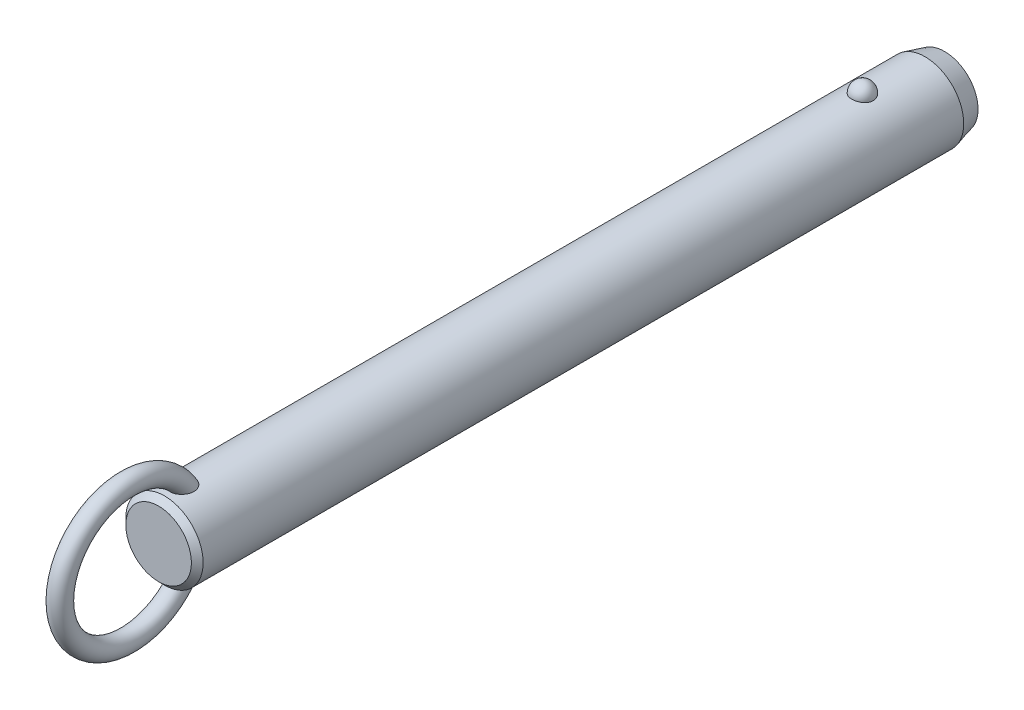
ISO-10303-21;
HEADER;
FILE_DESCRIPTION(('STEP AP214'),'2;1');
FILE_NAME('part.step','',(''),(''),'','','');
FILE_SCHEMA(('AUTOMOTIVE_DESIGN { 1 0 10303 214 1 1 1 1 }'));
ENDSEC;
DATA;
#1=APPLICATION_CONTEXT('core data for automotive mechanical design processes');
#2=APPLICATION_PROTOCOL_DEFINITION('international standard','automotive_design',2000,#1);
#3=PRODUCT_CONTEXT('',#1,'mechanical');
#4=PRODUCT('Part','Part','',(#3));
#5=PRODUCT_RELATED_PRODUCT_CATEGORY('part','',(#4));
#6=PRODUCT_DEFINITION_FORMATION('','',#4);
#7=PRODUCT_DEFINITION_CONTEXT('part definition',#1,'design');
#8=PRODUCT_DEFINITION('design','',#6,#7);
#9=PRODUCT_DEFINITION_SHAPE('','',#8);
#10=(LENGTH_UNIT() NAMED_UNIT(*) SI_UNIT(.MILLI.,.METRE.));
#11=(NAMED_UNIT(*) PLANE_ANGLE_UNIT() SI_UNIT($,.RADIAN.));
#12=(NAMED_UNIT(*) SI_UNIT($,.STERADIAN.) SOLID_ANGLE_UNIT());
#13=UNCERTAINTY_MEASURE_WITH_UNIT(LENGTH_MEASURE(1.E-05),#10,'distance_accuracy_value','');
#14=(GEOMETRIC_REPRESENTATION_CONTEXT(3) GLOBAL_UNCERTAINTY_ASSIGNED_CONTEXT((#13)) GLOBAL_UNIT_ASSIGNED_CONTEXT((#10,
#11,#12)) REPRESENTATION_CONTEXT('',''));
#15=CARTESIAN_POINT('',(0.,0.,0.));
#16=DIRECTION('',(0.,0.,1.));
#17=DIRECTION('',(1.,0.,0.));
#18=AXIS2_PLACEMENT_3D('',#15,#16,#17);
#19=CARTESIAN_POINT('',(0.,0.,132.1));
#20=DIRECTION('',(0.,0.,-1.));
#21=DIRECTION('',(-1.,0.,0.));
#22=AXIS2_PLACEMENT_3D('',#19,#20,#21);
#23=CYLINDRICAL_SURFACE('',#22,7.9);
#24=CARTESIAN_POINT('',(2.1785689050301,7.59367088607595,-2.19999999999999));
#25=CARTESIAN_POINT('',(2.17856679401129,7.59367269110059,-2.07701843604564));
#26=CARTESIAN_POINT('',(2.16853481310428,7.59657145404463,-1.95401006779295));
#27=CARTESIAN_POINT('',(2.12864689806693,7.607843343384,-1.71147811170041));
#28=CARTESIAN_POINT('',(2.09878338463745,7.61621856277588,-1.59195587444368));
#29=CARTESIAN_POINT('',(2.0199931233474,7.63749180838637,-1.3598563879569));
#30=CARTESIAN_POINT('',(1.97107475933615,7.6503878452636,-1.24727610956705));
#31=CARTESIAN_POINT('',(1.85539377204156,7.67926115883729,-1.03213234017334));
#32=CARTESIAN_POINT('',(1.78863158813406,7.69523835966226,-0.929568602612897));
#33=CARTESIAN_POINT('',(1.63856494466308,7.7285848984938,-0.736786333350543));
#34=CARTESIAN_POINT('',(1.55518140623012,7.7459606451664,-0.646630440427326));
#35=CARTESIAN_POINT('',(1.37422937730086,7.78009978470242,-0.481747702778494));
#36=CARTESIAN_POINT('',(1.27666086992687,7.79686317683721,-0.407020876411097));
#37=CARTESIAN_POINT('',(1.07024728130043,7.82786153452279,-0.275278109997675));
#38=CARTESIAN_POINT('',(0.961434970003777,7.84210353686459,-0.218212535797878));
#39=CARTESIAN_POINT('',(0.735351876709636,7.86652194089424,-0.123146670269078));
#40=CARTESIAN_POINT('',(0.618082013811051,7.87669878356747,-0.085144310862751));
#41=CARTESIAN_POINT('',(0.380637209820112,7.89170521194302,-0.0298158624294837));
#42=CARTESIAN_POINT('',(0.260550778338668,7.89662650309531,-0.0121347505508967));
#43=CARTESIAN_POINT('',(0.0190117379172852,7.90090003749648,0.00324379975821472));
#44=CARTESIAN_POINT('',(-0.102440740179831,7.90025280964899,0.00094313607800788));
#45=CARTESIAN_POINT('',(-0.341452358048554,7.89351056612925,-0.0233955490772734));
#46=CARTESIAN_POINT('',(-0.459042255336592,7.88749257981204,-0.0451545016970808));
#47=CARTESIAN_POINT('',(-0.688796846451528,7.87075812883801,-0.107408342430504));
#48=CARTESIAN_POINT('',(-0.800961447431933,7.86004158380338,-0.147903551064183));
#49=CARTESIAN_POINT('',(-1.01743634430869,7.83497131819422,-0.246799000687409));
#50=CARTESIAN_POINT('',(-1.12169791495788,7.82059709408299,-0.305300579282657));
#51=CARTESIAN_POINT('',(-1.31891765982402,7.78976470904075,-0.438549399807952));
#52=CARTESIAN_POINT('',(-1.41187469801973,7.77330633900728,-0.513298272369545));
#53=CARTESIAN_POINT('',(-1.58577142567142,7.73972434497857,-0.678622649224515));
#54=CARTESIAN_POINT('',(-1.66645140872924,7.72259402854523,-0.769470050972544));
#55=CARTESIAN_POINT('',(-1.81161503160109,7.68983776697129,-0.963538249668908));
#56=CARTESIAN_POINT('',(-1.87609753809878,7.6742119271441,-1.06675991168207));
#57=CARTESIAN_POINT('',(-1.98790138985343,7.6460202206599,-1.28401170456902));
#58=CARTESIAN_POINT('',(-2.03501994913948,7.63349104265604,-1.39815107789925));
#59=CARTESIAN_POINT('',(-2.10986724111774,7.6131449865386,-1.63301784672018));
#60=CARTESIAN_POINT('',(-2.1375965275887,7.60532797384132,-1.75374505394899));
#61=CARTESIAN_POINT('',(-2.17289256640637,7.5953195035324,-1.99782562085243));
#62=CARTESIAN_POINT('',(-2.18054294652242,7.59310471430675,-2.12116592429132));
#63=CARTESIAN_POINT('',(-2.17572919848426,7.59448538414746,-2.36741799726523));
#64=CARTESIAN_POINT('',(-2.1632656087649,7.59808068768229,-2.49032977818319));
#65=CARTESIAN_POINT('',(-2.11865035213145,7.61064035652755,-2.73161015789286));
#66=CARTESIAN_POINT('',(-2.08659579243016,7.61957823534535,-2.84999812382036));
#67=CARTESIAN_POINT('',(-2.00367799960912,7.64179982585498,-3.07955956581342));
#68=CARTESIAN_POINT('',(-1.9528140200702,7.65508371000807,-3.19073275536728));
#69=CARTESIAN_POINT('',(-1.83321113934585,7.68460381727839,-3.40337899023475));
#70=CARTESIAN_POINT('',(-1.76437735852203,7.70085556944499,-3.50479651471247));
#71=CARTESIAN_POINT('',(-1.61069526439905,7.73445734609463,-3.69446912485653));
#72=CARTESIAN_POINT('',(-1.52584634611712,7.75180741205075,-3.78272371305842));
#73=CARTESIAN_POINT('',(-1.34198059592,7.78574608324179,-3.94393987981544));
#74=CARTESIAN_POINT('',(-1.24291308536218,7.80233167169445,-4.01684434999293));
#75=CARTESIAN_POINT('',(-1.03352039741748,7.83281625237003,-4.14489386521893));
#76=CARTESIAN_POINT('',(-0.92319600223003,7.84671543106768,-4.20004014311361));
#77=CARTESIAN_POINT('',(-0.695822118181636,7.87011575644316,-4.29042017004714));
#78=CARTESIAN_POINT('',(-0.578872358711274,7.87966903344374,-4.32589112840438));
#79=CARTESIAN_POINT('',(-0.340410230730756,7.8935652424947,-4.37692226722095));
#80=CARTESIAN_POINT('',(-0.218898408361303,7.89790879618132,-4.39248482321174));
#81=CARTESIAN_POINT('',(0.0228107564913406,7.90087453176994,-4.40314405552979));
#82=CARTESIAN_POINT('',(0.142990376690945,7.89960185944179,-4.39861683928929));
#83=CARTESIAN_POINT('',(0.380829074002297,7.89171262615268,-4.37008293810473));
#84=CARTESIAN_POINT('',(0.498488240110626,7.8850962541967,-4.34607694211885));
#85=CARTESIAN_POINT('',(0.727535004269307,7.86726442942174,-4.27939317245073));
#86=CARTESIAN_POINT('',(0.838944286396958,7.85606616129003,-4.236785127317));
#87=CARTESIAN_POINT('',(1.05295421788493,7.83025654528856,-4.13408348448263));
#88=CARTESIAN_POINT('',(1.15555431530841,7.81564498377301,-4.07398879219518));
#89=CARTESIAN_POINT('',(1.35076763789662,7.7843022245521,-3.93687432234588));
#90=CARTESIAN_POINT('',(1.4432046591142,7.76754209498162,-3.85961036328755));
#91=CARTESIAN_POINT('',(1.6139111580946,7.73387857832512,-3.69076949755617));
#92=CARTESIAN_POINT('',(1.6921781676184,7.71697516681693,-3.59919010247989));
#93=CARTESIAN_POINT('',(1.83380875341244,7.6845643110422,-3.40247278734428));
#94=CARTESIAN_POINT('',(1.89689280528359,7.66908588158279,-3.29712873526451));
#95=CARTESIAN_POINT('',(2.0047823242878,7.64159441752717,-3.07707931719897));
#96=CARTESIAN_POINT('',(2.0495945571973,7.62958010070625,-2.96237743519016));
#97=CARTESIAN_POINT('',(2.11580183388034,7.61146617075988,-2.74040519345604));
#98=CARTESIAN_POINT('',(2.13929812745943,7.60484503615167,-2.63379846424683));
#99=CARTESIAN_POINT('',(2.17068242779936,7.59594664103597,-2.41813481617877));
#100=CARTESIAN_POINT('',(2.17857077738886,7.59366928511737,-2.30907795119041));
#101=CARTESIAN_POINT('',(2.1785689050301,7.59367088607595,-2.19999999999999));
#102=B_SPLINE_CURVE_WITH_KNOTS('',3,(#24,#25,#26,#27,#28,#29,#30,#31,#32,#33,#34,#35,#36,#37,
#38,#39,#40,#41,#42,#43,#44,#45,#46,#47,#48,#49,#50,#51,#52,#53,#54,#55,#56,#57,#58,#59,#60,#61,
#62,#63,#64,#65,#66,#67,#68,#69,#70,#71,#72,#73,#74,#75,#76,#77,#78,#79,#80,#81,#82,#83,#84,#85,
#86,#87,#88,#89,#90,#91,#92,#93,#94,#95,#96,#97,#98,#99,#100,#101),.UNSPECIFIED.,.T.,.F.,(4,2,2,
2,2,2,2,2,2,2,2,2,2,2,2,2,2,2,2,2,2,2,2,2,2,2,2,2,2,2,2,2,2,2,2,2,2,2,4),(0.,0.368552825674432,
0.737246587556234,1.10577831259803,1.4743009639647,1.8446206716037,2.21494081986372,
2.5842105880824,2.95344028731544,3.31611630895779,3.67875788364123,4.03628044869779,
4.39380913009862,4.75338791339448,5.11300280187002,5.47939989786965,5.8458226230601,
6.21639834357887,6.58696347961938,6.95598276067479,7.32499216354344,7.69218715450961,
8.0593967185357,8.42858578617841,8.79778880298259,9.16834203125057,9.5388695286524,
9.90482699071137,10.2707407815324,10.6298333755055,10.9889132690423,11.3466585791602,
11.7044262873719,12.0676511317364,12.4309391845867,12.8004764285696,13.1698767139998,
13.4967701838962,13.8236564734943),.UNSPECIFIED.);
#103=CARTESIAN_POINT('',(2.1785689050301,7.59367088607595,-2.19999999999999));
#104=VERTEX_POINT('',#103);
#105=EDGE_CURVE('E41',#104,#104,#102,.T.);
#106=ORIENTED_EDGE('',*,*,#105,.T.);
#107=EDGE_LOOP('',(#106));
#108=FACE_BOUND('',#107,.T.);
#109=CARTESIAN_POINT('',(0.,0.,140.42));
#110=DIRECTION('',(0.,0.,1.));
#111=DIRECTION('',(1.,0.,0.));
#112=AXIS2_PLACEMENT_3D('',#109,#110,#111);
#113=CIRCLE('',#112,7.9);
#114=CARTESIAN_POINT('',(7.9,0.,140.42));
#115=VERTEX_POINT('',#114);
#116=EDGE_CURVE('E10',#115,#115,#113,.F.);
#117=ORIENTED_EDGE('',*,*,#116,.T.);
#118=EDGE_LOOP('',(#117));
#119=FACE_BOUND('',#118,.T.);
#120=CARTESIAN_POINT('',(-0.630969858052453,-7.87476203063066,134.312432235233));
#121=CARTESIAN_POINT('',(-0.734180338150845,-7.86648998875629,134.347285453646));
#122=CARTESIAN_POINT('',(-0.83447695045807,-7.85639291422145,134.390816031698));
#123=CARTESIAN_POINT('',(-1.0262035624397,-7.83366343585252,134.494094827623));
#124=CARTESIAN_POINT('',(-1.1176141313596,-7.82102565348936,134.553877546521));
#125=CARTESIAN_POINT('',(-1.28877277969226,-7.79464922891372,134.687839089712));
#126=CARTESIAN_POINT('',(-1.36854014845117,-7.78091246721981,134.761993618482));
#127=CARTESIAN_POINT('',(-1.51461521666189,-7.75380398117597,134.922494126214));
#128=CARTESIAN_POINT('',(-1.58092966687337,-7.74043207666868,135.008833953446));
#129=CARTESIAN_POINT('',(-1.70019064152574,-7.7151252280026,135.192978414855));
#130=CARTESIAN_POINT('',(-1.75284037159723,-7.70322473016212,135.290979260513));
#131=CARTESIAN_POINT('',(-1.84263464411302,-7.68224112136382,135.494102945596));
#132=CARTESIAN_POINT('',(-1.87977299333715,-7.6731591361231,135.599228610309));
#133=CARTESIAN_POINT('',(-1.94152728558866,-7.65777930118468,135.823284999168));
#134=CARTESIAN_POINT('',(-1.96475471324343,-7.65179654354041,135.942616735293));
#135=CARTESIAN_POINT('',(-1.99449499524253,-7.64409642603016,136.18342986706));
#136=CARTESIAN_POINT('',(-2.0010005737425,-7.64238092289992,136.304912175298));
#137=CARTESIAN_POINT('',(-1.99856014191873,-7.64302120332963,136.568340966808));
#138=CARTESIAN_POINT('',(-1.98680021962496,-7.64611845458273,136.71025654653));
#139=CARTESIAN_POINT('',(-1.94457772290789,-7.65696186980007,136.991118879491));
#140=CARTESIAN_POINT('',(-1.91409393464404,-7.66471330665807,137.130062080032));
#141=CARTESIAN_POINT('',(-1.82768670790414,-7.68582947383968,137.431939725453));
#142=CARTESIAN_POINT('',(-1.76772963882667,-7.70003779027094,137.593686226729));
#143=CARTESIAN_POINT('',(-1.65998501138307,-7.72371550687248,137.827695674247));
#144=CARTESIAN_POINT('',(-1.621079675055,-7.73200670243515,137.904297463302));
#145=CARTESIAN_POINT('',(-1.53727726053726,-7.74910377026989,138.054079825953));
#146=CARTESIAN_POINT('',(-1.49238215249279,-7.75790947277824,138.127261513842));
#147=CARTESIAN_POINT('',(-1.37397050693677,-7.77993338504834,138.30288382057));
#148=CARTESIAN_POINT('',(-1.29690364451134,-7.79328473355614,138.402955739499));
#149=CARTESIAN_POINT('',(-1.12885487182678,-7.81939266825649,138.590714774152));
#150=CARTESIAN_POINT('',(-1.03789926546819,-7.83215032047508,138.678424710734));
#151=CARTESIAN_POINT('',(-0.869532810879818,-7.85231710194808,138.813414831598));
#152=CARTESIAN_POINT('',(-0.795716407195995,-7.86021093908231,138.865076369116));
#153=CARTESIAN_POINT('',(-0.640813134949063,-7.87434920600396,138.956381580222));
#154=CARTESIAN_POINT('',(-0.559737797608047,-7.88059619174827,138.99604389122));
#155=CARTESIAN_POINT('',(-0.406456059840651,-7.88984116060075,139.054300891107));
#156=CARTESIAN_POINT('',(-0.335227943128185,-7.89321892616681,139.075384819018));
#157=CARTESIAN_POINT('',(-0.190193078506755,-7.89804235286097,139.10541418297));
#158=CARTESIAN_POINT('',(-0.116388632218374,-7.89948969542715,139.114370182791));
#159=CARTESIAN_POINT('',(0.0318414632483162,-7.90028409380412,139.119291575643));
#160=CARTESIAN_POINT('',(0.106268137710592,-7.89962640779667,139.115227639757));
#161=CARTESIAN_POINT('',(0.253290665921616,-7.8962818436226,139.094461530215));
#162=CARTESIAN_POINT('',(0.325885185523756,-7.8935935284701,139.077750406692));
#163=CARTESIAN_POINT('',(0.481441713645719,-7.88577340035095,139.028738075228));
#164=CARTESIAN_POINT('',(0.563611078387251,-7.88026321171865,138.994005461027));
#165=CARTESIAN_POINT('',(0.721129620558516,-7.86741729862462,138.911796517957));
#166=CARTESIAN_POINT('',(0.79646633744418,-7.86007832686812,138.864297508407));
#167=CARTESIAN_POINT('',(0.971456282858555,-7.84073285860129,138.736513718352));
#168=CARTESIAN_POINT('',(1.06719686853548,-7.82809461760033,138.651004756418));
#169=CARTESIAN_POINT('',(1.24418921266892,-7.80192439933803,138.466232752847));
#170=CARTESIAN_POINT('',(1.32540832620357,-7.78839049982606,138.366939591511));
#171=CARTESIAN_POINT('',(1.45199971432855,-7.76559693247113,138.189576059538));
#172=CARTESIAN_POINT('',(1.50085649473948,-7.75626094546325,138.113954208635));
#173=CARTESIAN_POINT('',(1.59197749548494,-7.73807279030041,137.958742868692));
#174=CARTESIAN_POINT('',(1.63423919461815,-7.72922080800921,137.879151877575));
#175=CARTESIAN_POINT('',(1.71222612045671,-7.71231959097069,137.716664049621));
#176=CARTESIAN_POINT('',(1.74794516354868,-7.70427111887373,137.633764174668));
#177=CARTESIAN_POINT('',(1.81270113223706,-7.68929240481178,137.465296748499));
#178=CARTESIAN_POINT('',(1.84173789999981,-7.68236218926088,137.379729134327));
#179=CARTESIAN_POINT('',(1.89322698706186,-7.6698375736,137.20528702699));
#180=CARTESIAN_POINT('',(1.91558744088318,-7.66426199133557,137.116383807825));
#181=CARTESIAN_POINT('',(1.95281367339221,-7.65485915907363,136.936969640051));
#182=CARTESIAN_POINT('',(1.96767946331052,-7.65103190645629,136.846458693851));
#183=CARTESIAN_POINT('',(2.0002145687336,-7.64262981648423,136.573732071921));
#184=CARTESIAN_POINT('',(2.00600691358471,-7.6410871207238,136.389709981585));
#185=CARTESIAN_POINT('',(1.98445334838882,-7.64669564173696,136.076501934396));
#186=CARTESIAN_POINT('',(1.96607186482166,-7.65149688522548,135.946618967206));
#187=CARTESIAN_POINT('',(1.90884967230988,-7.66597624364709,135.691632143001));
#188=CARTESIAN_POINT('',(1.87002101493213,-7.67565148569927,135.566525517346));
#189=CARTESIAN_POINT('',(1.77063986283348,-7.69918471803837,135.32454013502));
#190=CARTESIAN_POINT('',(1.70993724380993,-7.71307150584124,135.207725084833));
#191=CARTESIAN_POINT('',(1.56733070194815,-7.74330306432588,134.988144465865));
#192=CARTESIAN_POINT('',(1.48543692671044,-7.75964665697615,134.885372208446));
#193=CARTESIAN_POINT('',(1.31346177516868,-7.79047523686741,134.709380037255));
#194=CARTESIAN_POINT('',(1.22547278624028,-7.80495298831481,134.634106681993));
#195=CARTESIAN_POINT('',(1.03724352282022,-7.83218597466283,134.500486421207));
#196=CARTESIAN_POINT('',(0.93700840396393,-7.84494192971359,134.442132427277));
#197=CARTESIAN_POINT('',(0.733599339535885,-7.86649045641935,134.347027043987));
#198=CARTESIAN_POINT('',(0.630941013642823,-7.87547134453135,134.309210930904));
#199=CARTESIAN_POINT('',(0.420465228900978,-7.88950708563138,134.251116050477));
#200=CARTESIAN_POINT('',(0.312645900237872,-7.89456050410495,134.23084369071));
#201=CARTESIAN_POINT('',(0.096086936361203,-7.9001518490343,134.208455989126));
#202=CARTESIAN_POINT('',(-0.0126341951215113,-7.90073226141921,134.206169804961));
#203=CARTESIAN_POINT('',(-0.228766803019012,-7.89742350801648,134.219367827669));
#204=CARTESIAN_POINT('',(-0.336180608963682,-7.89354403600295,134.234813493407));
#205=CARTESIAN_POINT('',(-0.473410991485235,-7.88586871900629,134.266217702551));
#206=CARTESIAN_POINT('',(-0.50525779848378,-7.88388984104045,134.274354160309));
#207=CARTESIAN_POINT('',(-0.56848128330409,-7.87958326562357,134.292208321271));
#208=CARTESIAN_POINT('',(-0.59985795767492,-7.87725556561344,134.301926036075));
#209=CARTESIAN_POINT('',(-0.630969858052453,-7.87476203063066,134.312432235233));
#210=B_SPLINE_CURVE_WITH_KNOTS('',3,(#120,#121,#122,#123,#124,#125,#126,#127,#128,#129,#130,
#131,#132,#133,#134,#135,#136,#137,#138,#139,#140,#141,#142,#143,#144,#145,#146,#147,#148,#149,
#150,#151,#152,#153,#154,#155,#156,#157,#158,#159,#160,#161,#162,#163,#164,#165,#166,#167,#168,
#169,#170,#171,#172,#173,#174,#175,#176,#177,#178,#179,#180,#181,#182,#183,#184,#185,#186,#187,
#188,#189,#190,#191,#192,#193,#194,#195,#196,#197,#198,#199,#200,#201,#202,#203,#204,#205,#206,
#207,#208,#209),.UNSPECIFIED.,.T.,.F.,(4,2,2,2,2,2,2,2,2,2,2,2,2,2,2,2,2,2,2,2,2,2,2,2,2,2,2,2,
2,2,2,2,2,2,2,2,2,2,2,2,2,2,2,2,4),(0.,0.327622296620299,0.655945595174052,0.983718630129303,
1.3113267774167,1.64554655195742,1.97989964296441,2.34365728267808,2.70757317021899,
3.13333684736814,3.5595838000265,4.07655306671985,4.33527897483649,4.59391999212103,
4.97382437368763,5.353017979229,5.62348245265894,5.89352465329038,6.11565959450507,
6.33760092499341,6.56004255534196,6.78264174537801,7.04930844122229,7.31645206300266,
7.70130871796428,8.08701995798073,8.35824509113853,8.6295736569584,8.9011573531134,
9.1727474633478,9.44791855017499,9.72308922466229,10.2715298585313,10.6638393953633,
11.0559179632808,11.4507403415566,11.8453740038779,12.1936425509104,12.5417649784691,
12.8695063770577,13.1973674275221,13.5221104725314,13.8461490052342,13.9449071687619,
14.0436660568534),.UNSPECIFIED.);
#211=CARTESIAN_POINT('',(-0.630969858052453,-7.87476203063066,134.312432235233));
#212=VERTEX_POINT('',#211);
#213=EDGE_CURVE('E59',#212,#212,#210,.T.);
#214=ORIENTED_EDGE('',*,*,#213,.T.);
#215=EDGE_LOOP('',(#214));
#216=FACE_BOUND('',#215,.T.);
#217=CARTESIAN_POINT('',(-0.630969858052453,7.87476203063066,134.312432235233));
#218=CARTESIAN_POINT('',(-0.528918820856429,7.88293636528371,134.277979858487));
#219=CARTESIAN_POINT('',(-0.423745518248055,7.88934810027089,134.251915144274));
#220=CARTESIAN_POINT('',(-0.210236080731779,7.8979273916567,134.217282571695));
#221=CARTESIAN_POINT('',(-0.10189380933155,7.90008607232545,134.208751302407));
#222=CARTESIAN_POINT('',(0.114660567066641,7.89990877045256,134.209457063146));
#223=CARTESIAN_POINT('',(0.222872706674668,7.89757640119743,134.21867980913));
#224=CARTESIAN_POINT('',(0.436107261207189,7.88867538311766,134.254652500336));
#225=CARTESIAN_POINT('',(0.541131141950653,7.8821087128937,134.28139425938));
#226=CARTESIAN_POINT('',(0.745085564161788,7.86545130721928,134.351756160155));
#227=CARTESIAN_POINT('',(0.844015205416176,7.85536005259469,134.395378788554));
#228=CARTESIAN_POINT('',(1.03299167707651,7.83275153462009,134.498379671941));
#229=CARTESIAN_POINT('',(1.12303841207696,7.8202342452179,134.557758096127));
#230=CARTESIAN_POINT('',(1.29214734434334,7.79408219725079,134.690864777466));
#231=CARTESIAN_POINT('',(1.37116907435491,7.78044359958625,134.764643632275));
#232=CARTESIAN_POINT('',(1.51597677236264,7.75353170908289,134.924235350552));
#233=CARTESIAN_POINT('',(1.58176261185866,7.74025841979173,135.010048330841));
#234=CARTESIAN_POINT('',(1.70057386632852,7.71504069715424,135.193644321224));
#235=CARTESIAN_POINT('',(1.75320073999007,7.7031425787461,135.291690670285));
#236=CARTESIAN_POINT('',(1.8429376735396,7.68216822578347,135.494893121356));
#237=CARTESIAN_POINT('',(1.88004278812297,7.67309289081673,135.600051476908));
#238=CARTESIAN_POINT('',(1.9417232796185,7.6577294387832,135.824167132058));
#239=CARTESIAN_POINT('',(1.96491037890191,7.65175648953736,135.943524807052));
#240=CARTESIAN_POINT('',(1.9945689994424,7.64407702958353,136.184384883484));
#241=CARTESIAN_POINT('',(2.00103304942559,7.64237242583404,136.30588821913));
#242=CARTESIAN_POINT('',(1.99850166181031,7.64303650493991,136.569368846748));
#243=CARTESIAN_POINT('',(1.98669038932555,7.64614714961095,136.711314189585));
#244=CARTESIAN_POINT('',(1.94436120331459,7.65701701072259,136.992228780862));
#245=CARTESIAN_POINT('',(1.91382203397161,7.66478150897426,137.131194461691));
#246=CARTESIAN_POINT('',(1.82728754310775,7.68592483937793,137.433111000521));
#247=CARTESIAN_POINT('',(1.76725778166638,7.70014685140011,137.594872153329));
#248=CARTESIAN_POINT('',(1.65939700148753,7.72384204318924,137.828891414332));
#249=CARTESIAN_POINT('',(1.62045187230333,7.73213852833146,137.905494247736));
#250=CARTESIAN_POINT('',(1.5365668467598,7.74924489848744,138.055273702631));
#251=CARTESIAN_POINT('',(1.49162892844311,7.75805461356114,138.128451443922));
#252=CARTESIAN_POINT('',(1.37317698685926,7.78007342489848,138.303952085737));
#253=CARTESIAN_POINT('',(1.29612360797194,7.79341423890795,138.403911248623));
#254=CARTESIAN_POINT('',(1.12812043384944,7.81949839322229,138.59145083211));
#255=CARTESIAN_POINT('',(1.03719688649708,7.83224280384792,138.679054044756));
#256=CARTESIAN_POINT('',(0.868871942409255,7.85239026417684,138.81389715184));
#257=CARTESIAN_POINT('',(0.795056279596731,7.86027769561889,138.865511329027));
#258=CARTESIAN_POINT('',(0.640160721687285,7.87440222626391,138.956720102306));
#259=CARTESIAN_POINT('',(0.559092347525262,7.88064188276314,138.996333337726));
#260=CARTESIAN_POINT('',(0.405820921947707,7.8898738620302,139.054505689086));
#261=CARTESIAN_POINT('',(0.334594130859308,7.89324577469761,139.075552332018));
#262=CARTESIAN_POINT('',(0.189568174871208,7.89805733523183,139.105507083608));
#263=CARTESIAN_POINT('',(0.115771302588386,7.89949866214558,139.114425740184));
#264=CARTESIAN_POINT('',(-0.0324359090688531,7.90028156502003,139.11927589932));
#265=CARTESIAN_POINT('',(-0.106847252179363,7.89961843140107,139.115178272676));
#266=CARTESIAN_POINT('',(-0.253834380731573,7.8962642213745,139.094351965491));
#267=CARTESIAN_POINT('',(-0.326408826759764,7.89357170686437,139.077614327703));
#268=CARTESIAN_POINT('',(-0.481962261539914,7.88574179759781,139.028539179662));
#269=CARTESIAN_POINT('',(-0.564145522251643,7.88022507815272,138.993763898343));
#270=CARTESIAN_POINT('',(-0.721685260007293,7.86736646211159,138.911468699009));
#271=CARTESIAN_POINT('',(-0.797029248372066,7.8600213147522,138.863926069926));
#272=CARTESIAN_POINT('',(-0.9720442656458,7.84066026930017,138.736026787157));
#273=CARTESIAN_POINT('',(-1.06779803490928,7.82801274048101,138.650443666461));
#274=CARTESIAN_POINT('',(-1.2448053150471,7.80182621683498,138.465522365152));
#275=CARTESIAN_POINT('',(-1.32602618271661,7.78828530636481,138.366154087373));
#276=CARTESIAN_POINT('',(-1.4525983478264,7.76548487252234,138.188680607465));
#277=CARTESIAN_POINT('',(-1.50143856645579,7.75614818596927,138.113025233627));
#278=CARTESIAN_POINT('',(-1.59252410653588,7.73796020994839,137.957748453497));
#279=CARTESIAN_POINT('',(-1.63476690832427,7.72910910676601,137.878125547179));
#280=CARTESIAN_POINT('',(-1.71271318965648,7.71221133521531,137.715575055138));
#281=CARTESIAN_POINT('',(-1.74841047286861,7.70416543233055,137.632644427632));
#282=CARTESIAN_POINT('',(-1.81311929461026,7.6891937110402,137.464116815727));
#283=CARTESIAN_POINT('',(-1.84213067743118,7.68226791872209,137.378519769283));
#284=CARTESIAN_POINT('',(-1.89356259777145,7.66975461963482,137.204025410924));
#285=CARTESIAN_POINT('',(-1.91589165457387,7.66418586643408,137.115099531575));
#286=CARTESIAN_POINT('',(-1.9530507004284,7.65479859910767,136.935642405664));
#287=CARTESIAN_POINT('',(-1.96788069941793,7.65098008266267,136.845111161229));
#288=CARTESIAN_POINT('',(-2.00030078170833,7.64260704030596,136.572327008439));
#289=CARTESIAN_POINT('',(-2.00600576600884,7.64108760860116,136.388271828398));
#290=CARTESIAN_POINT('',(-1.9842848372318,7.64673945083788,136.075080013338));
#291=CARTESIAN_POINT('',(-1.96583698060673,7.65155751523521,135.945240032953));
#292=CARTESIAN_POINT('',(-1.90848948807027,7.66606613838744,135.690361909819));
#293=CARTESIAN_POINT('',(-1.86960376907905,7.67575338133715,135.565320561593));
#294=CARTESIAN_POINT('',(-1.77013421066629,7.6993013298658,135.323500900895));
#295=CARTESIAN_POINT('',(-1.70940488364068,7.71318991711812,135.206784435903));
#296=CARTESIAN_POINT('',(-1.56672953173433,7.74342495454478,134.987340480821));
#297=CARTESIAN_POINT('',(-1.48478316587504,7.75977144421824,134.88461321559));
#298=CARTESIAN_POINT('',(-1.31266325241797,7.79061163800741,134.708643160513));
#299=CARTESIAN_POINT('',(-1.22456383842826,7.80509908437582,134.633358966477));
#300=CARTESIAN_POINT('',(-1.03622400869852,7.83231881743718,134.499865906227));
#301=CARTESIAN_POINT('',(-0.936015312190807,7.84505551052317,134.441613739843));
#302=CARTESIAN_POINT('',(-0.798824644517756,7.85957802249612,134.377540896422));
#303=CARTESIAN_POINT('',(-0.765787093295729,7.86286821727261,134.363224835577));
#304=CARTESIAN_POINT('',(-0.698939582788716,7.86909211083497,134.336436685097));
#305=CARTESIAN_POINT('',(-0.66512963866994,7.8720258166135,134.323964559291));
#306=CARTESIAN_POINT('',(-0.630969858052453,7.87476203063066,134.312432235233));
#307=B_SPLINE_CURVE_WITH_KNOTS('',3,(#217,#218,#219,#220,#221,#222,#223,#224,#225,#226,#227,
#228,#229,#230,#231,#232,#233,#234,#235,#236,#237,#238,#239,#240,#241,#242,#243,#244,#245,#246,
#247,#248,#249,#250,#251,#252,#253,#254,#255,#256,#257,#258,#259,#260,#261,#262,#263,#264,#265,
#266,#267,#268,#269,#270,#271,#272,#273,#274,#275,#276,#277,#278,#279,#280,#281,#282,#283,#284,
#285,#286,#287,#288,#289,#290,#291,#292,#293,#294,#295,#296,#297,#298,#299,#300,#301,#302,#303,
#304,#305,#306),.UNSPECIFIED.,.T.,.F.,(4,2,2,2,2,2,2,2,2,2,2,2,2,2,2,2,2,2,2,2,2,2,2,2,2,2,2,2,
2,2,2,2,2,2,2,2,2,2,2,2,2,2,2,2,4),(0.,0.323920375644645,0.648516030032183,0.972850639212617,
1.29703380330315,1.62126473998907,1.94549915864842,2.27089401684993,2.5962920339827,
2.93059633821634,3.26500707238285,3.6288164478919,3.99278833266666,4.4186542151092,
4.84500434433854,5.36209210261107,5.62087589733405,5.87957448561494,6.25918598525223,
6.63808782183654,6.90846748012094,7.17842501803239,7.40052350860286,7.6224287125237,
7.84483086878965,8.06739077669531,8.33414615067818,8.60137921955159,8.98641454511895,
9.37230415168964,9.64358673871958,9.91497268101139,10.1866142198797,10.4582620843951,
10.7334745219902,11.008686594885,11.5572126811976,11.9494246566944,12.3413699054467,
12.7359755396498,13.1305875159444,13.4791770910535,13.82687259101,13.9353013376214,
14.0437279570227),.UNSPECIFIED.);
#308=CARTESIAN_POINT('',(-0.630969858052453,7.87476203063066,134.312432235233));
#309=VERTEX_POINT('',#308);
#310=EDGE_CURVE('E67',#309,#309,#307,.T.);
#311=ORIENTED_EDGE('',*,*,#310,.T.);
#312=EDGE_LOOP('',(#311));
#313=FACE_BOUND('',#312,.T.);
#314=CARTESIAN_POINT('',(0.,0.,-14.9999999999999));
#315=DIRECTION('',(0.,0.,-1.));
#316=DIRECTION('',(-1.,0.,0.));
#317=AXIS2_PLACEMENT_3D('',#314,#315,#316);
#318=CIRCLE('',#317,7.9);
#319=CARTESIAN_POINT('',(-7.9,0.,-14.9999999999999));
#320=VERTEX_POINT('',#319);
#321=EDGE_CURVE('E56',#320,#320,#318,.F.);
#322=ORIENTED_EDGE('',*,*,#321,.T.);
#323=EDGE_LOOP('',(#322));
#324=FACE_BOUND('',#323,.T.);
#325=ADVANCED_FACE('F37',(#108,#119,#216,#313,#324),#23,.T.);
#326=CARTESIAN_POINT('',(0.,0.,-19.));
#327=DIRECTION('',(0.,0.,-1.));
#328=DIRECTION('',(-1.,0.,0.));
#329=AXIS2_PLACEMENT_3D('',#326,#327,#328);
#330=PLANE('',#329);
#331=CARTESIAN_POINT('',(0.,0.,-19.));
#332=DIRECTION('',(0.,0.,-1.));
#333=DIRECTION('',(-1.,0.,0.));
#334=AXIS2_PLACEMENT_3D('',#331,#332,#333);
#335=CIRCLE('',#334,6.82820323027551);
#336=CARTESIAN_POINT('',(-6.82820323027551,0.,-19.));
#337=VERTEX_POINT('',#336);
#338=EDGE_CURVE('E66',#337,#337,#335,.T.);
#339=ORIENTED_EDGE('',*,*,#338,.T.);
#340=EDGE_LOOP('',(#339));
#341=FACE_BOUND('',#340,.T.);
#342=ADVANCED_FACE('F85',(#341),#330,.T.);
#343=CARTESIAN_POINT('',(0.,0.,-19.));
#344=DIRECTION('',(0.,0.,1.));
#345=DIRECTION('',(1.,0.,0.));
#346=AXIS2_PLACEMENT_3D('',#343,#344,#345);
#347=CONICAL_SURFACE('',#346,6.82820323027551,0.261799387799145);
#348=ORIENTED_EDGE('',*,*,#321,.F.);
#349=EDGE_LOOP('',(#348));
#350=FACE_BOUND('',#349,.T.);
#351=ORIENTED_EDGE('',*,*,#338,.F.);
#352=EDGE_LOOP('',(#351));
#353=FACE_BOUND('',#352,.T.);
#354=ADVANCED_FACE('F83',(#350,#353),#347,.T.);
#355=CARTESIAN_POINT('',(0.,0.,141.62));
#356=DIRECTION('',(0.,0.,1.));
#357=DIRECTION('',(1.,0.,0.));
#358=AXIS2_PLACEMENT_3D('',#355,#356,#357);
#359=PLANE('',#358);
#360=CARTESIAN_POINT('',(0.,0.,141.62));
#361=DIRECTION('',(0.,0.,1.));
#362=DIRECTION('',(1.,0.,0.));
#363=AXIS2_PLACEMENT_3D('',#360,#361,#362);
#364=CIRCLE('',#363,6.70000000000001);
#365=CARTESIAN_POINT('',(6.70000000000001,0.,141.62));
#366=VERTEX_POINT('',#365);
#367=EDGE_CURVE('E50',#366,#366,#364,.T.);
#368=ORIENTED_EDGE('',*,*,#367,.T.);
#369=EDGE_LOOP('',(#368));
#370=FACE_BOUND('',#369,.T.);
#371=ADVANCED_FACE('F77',(#370),#359,.T.);
#372=CARTESIAN_POINT('',(0.,0.,147.95));
#373=DIRECTION('',(1.,0.,0.));
#374=DIRECTION('',(0.,0.,-1.));
#375=AXIS2_PLACEMENT_3D('',#372,#373,#374);
#376=TOROIDAL_SURFACE('',#375,13.85,2.);
#377=ORIENTED_EDGE('',*,*,#310,.F.);
#378=EDGE_LOOP('',(#377));
#379=FACE_BOUND('',#378,.T.);
#380=ORIENTED_EDGE('',*,*,#213,.F.);
#381=EDGE_LOOP('',(#380));
#382=FACE_BOUND('',#381,.T.);
#383=ADVANCED_FACE('F73',(#379,#382),#376,.T.);
#384=CARTESIAN_POINT('',(0.,0.,141.62));
#385=DIRECTION('',(0.,0.,-1.));
#386=DIRECTION('',(-1.,0.,0.));
#387=AXIS2_PLACEMENT_3D('',#384,#385,#386);
#388=CONICAL_SURFACE('',#387,6.70000000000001,0.785398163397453);
#389=ORIENTED_EDGE('',*,*,#116,.F.);
#390=EDGE_LOOP('',(#389));
#391=FACE_BOUND('',#390,.T.);
#392=ORIENTED_EDGE('',*,*,#367,.F.);
#393=EDGE_LOOP('',(#392));
#394=FACE_BOUND('',#393,.T.);
#395=ADVANCED_FACE('F39',(#391,#394),#388,.T.);
#396=CARTESIAN_POINT('',(0.,7.9,-2.19999999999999));
#397=DIRECTION('',(0.,1.,0.));
#398=DIRECTION('',(0.,0.,-1.));
#399=AXIS2_PLACEMENT_3D('',#396,#397,#398);
#400=SPHERICAL_SURFACE('',#399,2.2);
#401=ORIENTED_EDGE('',*,*,#105,.F.);
#402=EDGE_LOOP('',(#401));
#403=FACE_BOUND('',#402,.T.);
#404=ADVANCED_FACE('F79',(#403),#400,.T.);
#405=CLOSED_SHELL('',(#325,#342,#354,#371,#383,#395,#404));
#406=MANIFOLD_SOLID_BREP('B2',#405);
#407=ADVANCED_BREP_SHAPE_REPRESENTATION('',(#18,#406),#14);
#408=SHAPE_DEFINITION_REPRESENTATION(#9,#407);
ENDSEC;
END-ISO-10303-21;
